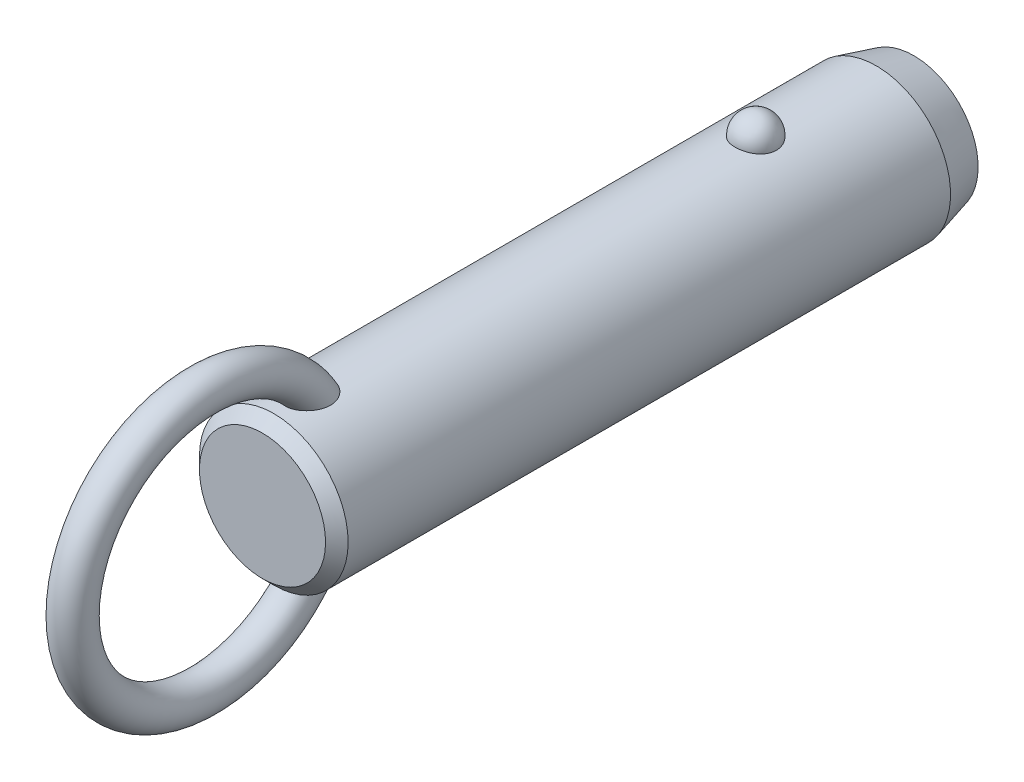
ISO-10303-21;
HEADER;
FILE_DESCRIPTION(('STEP AP214'),'2;1');
FILE_NAME('part.step','',(''),(''),'','','');
FILE_SCHEMA(('AUTOMOTIVE_DESIGN { 1 0 10303 214 1 1 1 1 }'));
ENDSEC;
DATA;
#1=APPLICATION_CONTEXT('core data for automotive mechanical design processes');
#2=APPLICATION_PROTOCOL_DEFINITION('international standard','automotive_design',2000,#1);
#3=PRODUCT_CONTEXT('',#1,'mechanical');
#4=PRODUCT('Part','Part','',(#3));
#5=PRODUCT_RELATED_PRODUCT_CATEGORY('part','',(#4));
#6=PRODUCT_DEFINITION_FORMATION('','',#4);
#7=PRODUCT_DEFINITION_CONTEXT('part definition',#1,'design');
#8=PRODUCT_DEFINITION('design','',#6,#7);
#9=PRODUCT_DEFINITION_SHAPE('','',#8);
#10=(LENGTH_UNIT() NAMED_UNIT(*) SI_UNIT(.MILLI.,.METRE.));
#11=(NAMED_UNIT(*) PLANE_ANGLE_UNIT() SI_UNIT($,.RADIAN.));
#12=(NAMED_UNIT(*) SI_UNIT($,.STERADIAN.) SOLID_ANGLE_UNIT());
#13=UNCERTAINTY_MEASURE_WITH_UNIT(LENGTH_MEASURE(1.E-05),#10,'distance_accuracy_value','');
#14=(GEOMETRIC_REPRESENTATION_CONTEXT(3) GLOBAL_UNCERTAINTY_ASSIGNED_CONTEXT((#13)) GLOBAL_UNIT_ASSIGNED_CONTEXT((#10,
#11,#12)) REPRESENTATION_CONTEXT('',''));
#15=CARTESIAN_POINT('',(0.,0.,0.));
#16=DIRECTION('',(0.,0.,1.));
#17=DIRECTION('',(1.,0.,0.));
#18=AXIS2_PLACEMENT_3D('',#15,#16,#17);
#19=CARTESIAN_POINT('',(0.,0.,40.7));
#20=DIRECTION('',(0.,0.,-1.));
#21=DIRECTION('',(-1.,0.,0.));
#22=AXIS2_PLACEMENT_3D('',#19,#20,#21);
#23=CYLINDRICAL_SURFACE('',#22,7.9);
#24=CARTESIAN_POINT('',(2.1785689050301,7.59367088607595,-2.2));
#25=CARTESIAN_POINT('',(2.17856679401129,7.59367269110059,-2.07701843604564));
#26=CARTESIAN_POINT('',(2.16853481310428,7.59657145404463,-1.95401006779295));
#27=CARTESIAN_POINT('',(2.12864689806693,7.607843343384,-1.71147811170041));
#28=CARTESIAN_POINT('',(2.09878338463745,7.61621856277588,-1.59195587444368));
#29=CARTESIAN_POINT('',(2.0199931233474,7.63749180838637,-1.35985638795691));
#30=CARTESIAN_POINT('',(1.97107475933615,7.6503878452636,-1.24727610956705));
#31=CARTESIAN_POINT('',(1.85539377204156,7.67926115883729,-1.03213234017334));
#32=CARTESIAN_POINT('',(1.78863158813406,7.69523835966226,-0.929568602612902));
#33=CARTESIAN_POINT('',(1.63856494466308,7.7285848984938,-0.736786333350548));
#34=CARTESIAN_POINT('',(1.55518140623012,7.7459606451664,-0.646630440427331));
#35=CARTESIAN_POINT('',(1.37422937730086,7.78009978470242,-0.481747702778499));
#36=CARTESIAN_POINT('',(1.27666086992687,7.79686317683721,-0.407020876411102));
#37=CARTESIAN_POINT('',(1.07024728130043,7.82786153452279,-0.27527810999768));
#38=CARTESIAN_POINT('',(0.961434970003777,7.84210353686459,-0.218212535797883));
#39=CARTESIAN_POINT('',(0.735351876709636,7.86652194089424,-0.123146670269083));
#40=CARTESIAN_POINT('',(0.618082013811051,7.87669878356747,-0.0851443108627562));
#41=CARTESIAN_POINT('',(0.380637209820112,7.89170521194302,-0.0298158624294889));
#42=CARTESIAN_POINT('',(0.260550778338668,7.89662650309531,-0.0121347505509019));
#43=CARTESIAN_POINT('',(0.0190117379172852,7.90090003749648,0.00324379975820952));
#44=CARTESIAN_POINT('',(-0.102440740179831,7.90025280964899,0.000943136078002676));
#45=CARTESIAN_POINT('',(-0.341452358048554,7.89351056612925,-0.0233955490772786));
#46=CARTESIAN_POINT('',(-0.459042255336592,7.88749257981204,-0.045154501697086));
#47=CARTESIAN_POINT('',(-0.688796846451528,7.87075812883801,-0.107408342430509));
#48=CARTESIAN_POINT('',(-0.800961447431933,7.86004158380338,-0.147903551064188));
#49=CARTESIAN_POINT('',(-1.01743634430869,7.83497131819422,-0.246799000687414));
#50=CARTESIAN_POINT('',(-1.12169791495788,7.82059709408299,-0.305300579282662));
#51=CARTESIAN_POINT('',(-1.31891765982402,7.78976470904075,-0.438549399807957));
#52=CARTESIAN_POINT('',(-1.41187469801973,7.77330633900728,-0.51329827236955));
#53=CARTESIAN_POINT('',(-1.58577142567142,7.73972434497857,-0.67862264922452));
#54=CARTESIAN_POINT('',(-1.66645140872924,7.72259402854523,-0.769470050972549));
#55=CARTESIAN_POINT('',(-1.81161503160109,7.68983776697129,-0.963538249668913));
#56=CARTESIAN_POINT('',(-1.87609753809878,7.6742119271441,-1.06675991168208));
#57=CARTESIAN_POINT('',(-1.98790138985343,7.6460202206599,-1.28401170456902));
#58=CARTESIAN_POINT('',(-2.03501994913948,7.63349104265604,-1.39815107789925));
#59=CARTESIAN_POINT('',(-2.10986724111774,7.6131449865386,-1.63301784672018));
#60=CARTESIAN_POINT('',(-2.1375965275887,7.60532797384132,-1.75374505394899));
#61=CARTESIAN_POINT('',(-2.17289256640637,7.5953195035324,-1.99782562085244));
#62=CARTESIAN_POINT('',(-2.18054294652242,7.59310471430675,-2.12116592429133));
#63=CARTESIAN_POINT('',(-2.17572919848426,7.59448538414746,-2.36741799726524));
#64=CARTESIAN_POINT('',(-2.1632656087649,7.59808068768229,-2.49032977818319));
#65=CARTESIAN_POINT('',(-2.11865035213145,7.61064035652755,-2.73161015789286));
#66=CARTESIAN_POINT('',(-2.08659579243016,7.61957823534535,-2.84999812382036));
#67=CARTESIAN_POINT('',(-2.00367799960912,7.64179982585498,-3.07955956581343));
#68=CARTESIAN_POINT('',(-1.9528140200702,7.65508371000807,-3.19073275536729));
#69=CARTESIAN_POINT('',(-1.83321113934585,7.68460381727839,-3.40337899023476));
#70=CARTESIAN_POINT('',(-1.76437735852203,7.70085556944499,-3.50479651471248));
#71=CARTESIAN_POINT('',(-1.61069526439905,7.73445734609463,-3.69446912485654));
#72=CARTESIAN_POINT('',(-1.52584634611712,7.75180741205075,-3.78272371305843));
#73=CARTESIAN_POINT('',(-1.34198059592,7.78574608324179,-3.94393987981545));
#74=CARTESIAN_POINT('',(-1.24291308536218,7.80233167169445,-4.01684434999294));
#75=CARTESIAN_POINT('',(-1.03352039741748,7.83281625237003,-4.14489386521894));
#76=CARTESIAN_POINT('',(-0.92319600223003,7.84671543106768,-4.20004014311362));
#77=CARTESIAN_POINT('',(-0.695822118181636,7.87011575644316,-4.29042017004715));
#78=CARTESIAN_POINT('',(-0.578872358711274,7.87966903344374,-4.32589112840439));
#79=CARTESIAN_POINT('',(-0.340410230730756,7.8935652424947,-4.37692226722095));
#80=CARTESIAN_POINT('',(-0.218898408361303,7.89790879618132,-4.39248482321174));
#81=CARTESIAN_POINT('',(0.0228107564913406,7.90087453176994,-4.4031440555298));
#82=CARTESIAN_POINT('',(0.142990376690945,7.89960185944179,-4.3986168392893));
#83=CARTESIAN_POINT('',(0.380829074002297,7.89171262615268,-4.37008293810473));
#84=CARTESIAN_POINT('',(0.498488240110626,7.8850962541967,-4.34607694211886));
#85=CARTESIAN_POINT('',(0.727535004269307,7.86726442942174,-4.27939317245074));
#86=CARTESIAN_POINT('',(0.838944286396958,7.85606616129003,-4.23678512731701));
#87=CARTESIAN_POINT('',(1.05295421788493,7.83025654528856,-4.13408348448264));
#88=CARTESIAN_POINT('',(1.15555431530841,7.81564498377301,-4.07398879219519));
#89=CARTESIAN_POINT('',(1.35076763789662,7.7843022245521,-3.93687432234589));
#90=CARTESIAN_POINT('',(1.4432046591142,7.76754209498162,-3.85961036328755));
#91=CARTESIAN_POINT('',(1.6139111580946,7.73387857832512,-3.69076949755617));
#92=CARTESIAN_POINT('',(1.6921781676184,7.71697516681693,-3.59919010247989));
#93=CARTESIAN_POINT('',(1.83380875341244,7.6845643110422,-3.40247278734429));
#94=CARTESIAN_POINT('',(1.89689280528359,7.66908588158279,-3.29712873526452));
#95=CARTESIAN_POINT('',(2.0047823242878,7.64159441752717,-3.07707931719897));
#96=CARTESIAN_POINT('',(2.0495945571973,7.62958010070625,-2.96237743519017));
#97=CARTESIAN_POINT('',(2.11580183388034,7.61146617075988,-2.74040519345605));
#98=CARTESIAN_POINT('',(2.13929812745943,7.60484503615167,-2.63379846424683));
#99=CARTESIAN_POINT('',(2.17068242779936,7.59594664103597,-2.41813481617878));
#100=CARTESIAN_POINT('',(2.17857077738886,7.59366928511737,-2.30907795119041));
#101=CARTESIAN_POINT('',(2.1785689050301,7.59367088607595,-2.2));
#102=B_SPLINE_CURVE_WITH_KNOTS('',3,(#24,#25,#26,#27,#28,#29,#30,#31,#32,#33,#34,#35,#36,#37,
#38,#39,#40,#41,#42,#43,#44,#45,#46,#47,#48,#49,#50,#51,#52,#53,#54,#55,#56,#57,#58,#59,#60,#61,
#62,#63,#64,#65,#66,#67,#68,#69,#70,#71,#72,#73,#74,#75,#76,#77,#78,#79,#80,#81,#82,#83,#84,#85,
#86,#87,#88,#89,#90,#91,#92,#93,#94,#95,#96,#97,#98,#99,#100,#101),.UNSPECIFIED.,.T.,.F.,(4,2,2,
2,2,2,2,2,2,2,2,2,2,2,2,2,2,2,2,2,2,2,2,2,2,2,2,2,2,2,2,2,2,2,2,2,2,2,4),(0.,0.368552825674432,
0.737246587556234,1.10577831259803,1.4743009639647,1.8446206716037,2.21494081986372,
2.5842105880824,2.95344028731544,3.31611630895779,3.67875788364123,4.03628044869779,
4.39380913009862,4.75338791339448,5.11300280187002,5.47939989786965,5.8458226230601,
6.21639834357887,6.58696347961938,6.95598276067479,7.32499216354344,7.69218715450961,
8.0593967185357,8.42858578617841,8.79778880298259,9.16834203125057,9.5388695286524,
9.90482699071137,10.2707407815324,10.6298333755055,10.9889132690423,11.3466585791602,
11.7044262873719,12.0676511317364,12.4309391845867,12.8004764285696,13.1698767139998,
13.4967701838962,13.8236564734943),.UNSPECIFIED.);
#103=CARTESIAN_POINT('',(2.1785689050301,7.59367088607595,-2.2));
#104=VERTEX_POINT('',#103);
#105=EDGE_CURVE('E41',#104,#104,#102,.T.);
#106=ORIENTED_EDGE('',*,*,#105,.T.);
#107=EDGE_LOOP('',(#106));
#108=FACE_BOUND('',#107,.T.);
#109=CARTESIAN_POINT('',(0.,0.,49.02));
#110=DIRECTION('',(0.,0.,1.));
#111=DIRECTION('',(1.,0.,0.));
#112=AXIS2_PLACEMENT_3D('',#109,#110,#111);
#113=CIRCLE('',#112,7.9);
#114=CARTESIAN_POINT('',(7.9,0.,49.02));
#115=VERTEX_POINT('',#114);
#116=EDGE_CURVE('E10',#115,#115,#113,.F.);
#117=ORIENTED_EDGE('',*,*,#116,.T.);
#118=EDGE_LOOP('',(#117));
#119=FACE_BOUND('',#118,.T.);
#120=CARTESIAN_POINT('',(-0.630969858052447,-7.87476203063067,42.9124322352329));
#121=CARTESIAN_POINT('',(-0.734180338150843,-7.8664899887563,42.947285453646));
#122=CARTESIAN_POINT('',(-0.83447695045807,-7.85639291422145,42.9908160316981));
#123=CARTESIAN_POINT('',(-1.0262035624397,-7.83366343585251,43.0940948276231));
#124=CARTESIAN_POINT('',(-1.1176141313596,-7.82102565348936,43.1538775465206));
#125=CARTESIAN_POINT('',(-1.28877277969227,-7.79464922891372,43.2878390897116));
#126=CARTESIAN_POINT('',(-1.36854014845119,-7.78091246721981,43.361993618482));
#127=CARTESIAN_POINT('',(-1.51461521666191,-7.75380398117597,43.5224941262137));
#128=CARTESIAN_POINT('',(-1.58092966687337,-7.74043207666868,43.6088339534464));
#129=CARTESIAN_POINT('',(-1.70019064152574,-7.71512522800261,43.7929784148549));
#130=CARTESIAN_POINT('',(-1.75284037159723,-7.70322473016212,43.8909792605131));
#131=CARTESIAN_POINT('',(-1.84263464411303,-7.68224112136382,44.0941029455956));
#132=CARTESIAN_POINT('',(-1.87977299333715,-7.6731591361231,44.1992286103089));
#133=CARTESIAN_POINT('',(-1.94152728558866,-7.65777930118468,44.4232849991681));
#134=CARTESIAN_POINT('',(-1.96475471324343,-7.65179654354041,44.5426167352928));
#135=CARTESIAN_POINT('',(-1.99449499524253,-7.64409642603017,44.7834298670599));
#136=CARTESIAN_POINT('',(-2.0010005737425,-7.64238092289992,44.9049121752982));
#137=CARTESIAN_POINT('',(-1.99856014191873,-7.64302120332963,45.1683409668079));
#138=CARTESIAN_POINT('',(-1.98680021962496,-7.64611845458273,45.3102565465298));
#139=CARTESIAN_POINT('',(-1.94457772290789,-7.65696186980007,45.5911188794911));
#140=CARTESIAN_POINT('',(-1.91409393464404,-7.66471330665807,45.7300620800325));
#141=CARTESIAN_POINT('',(-1.82768670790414,-7.68582947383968,46.0319397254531));
#142=CARTESIAN_POINT('',(-1.76772963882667,-7.70003779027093,46.193686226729));
#143=CARTESIAN_POINT('',(-1.65998501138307,-7.72371550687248,46.4276956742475));
#144=CARTESIAN_POINT('',(-1.62107967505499,-7.73200670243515,46.5042974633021));
#145=CARTESIAN_POINT('',(-1.53727726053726,-7.7491037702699,46.6540798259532));
#146=CARTESIAN_POINT('',(-1.4923821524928,-7.75790947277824,46.7272615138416));
#147=CARTESIAN_POINT('',(-1.37397050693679,-7.77993338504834,46.9028838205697));
#148=CARTESIAN_POINT('',(-1.29690364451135,-7.79328473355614,47.0029557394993));
#149=CARTESIAN_POINT('',(-1.12885487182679,-7.81939266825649,47.1907147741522));
#150=CARTESIAN_POINT('',(-1.03789926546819,-7.83215032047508,47.2784247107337));
#151=CARTESIAN_POINT('',(-0.869532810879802,-7.85231710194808,47.4134148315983));
#152=CARTESIAN_POINT('',(-0.795716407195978,-7.86021093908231,47.465076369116));
#153=CARTESIAN_POINT('',(-0.640813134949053,-7.87434920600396,47.5563815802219));
#154=CARTESIAN_POINT('',(-0.559737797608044,-7.88059619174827,47.5960438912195));
#155=CARTESIAN_POINT('',(-0.406456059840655,-7.88984116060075,47.6543008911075));
#156=CARTESIAN_POINT('',(-0.335227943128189,-7.89321892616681,47.6753848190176));
#157=CARTESIAN_POINT('',(-0.19019307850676,-7.89804235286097,47.7054141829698));
#158=CARTESIAN_POINT('',(-0.11638863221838,-7.89948969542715,47.7143701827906));
#159=CARTESIAN_POINT('',(0.0318414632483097,-7.90028409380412,47.7192915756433));
#160=CARTESIAN_POINT('',(0.106268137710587,-7.89962640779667,47.7152276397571));
#161=CARTESIAN_POINT('',(0.25329066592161,-7.8962818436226,47.6944615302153));
#162=CARTESIAN_POINT('',(0.325885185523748,-7.8935935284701,47.6777504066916));
#163=CARTESIAN_POINT('',(0.481441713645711,-7.88577340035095,47.6287380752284));
#164=CARTESIAN_POINT('',(0.563611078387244,-7.88026321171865,47.594005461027));
#165=CARTESIAN_POINT('',(0.721129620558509,-7.86741729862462,47.5117965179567));
#166=CARTESIAN_POINT('',(0.796466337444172,-7.86007832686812,47.4642975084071));
#167=CARTESIAN_POINT('',(0.971456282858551,-7.84073285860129,47.336513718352));
#168=CARTESIAN_POINT('',(1.06719686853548,-7.82809461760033,47.2510047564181));
#169=CARTESIAN_POINT('',(1.24418921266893,-7.80192439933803,47.066232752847));
#170=CARTESIAN_POINT('',(1.32540832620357,-7.78839049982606,46.9669395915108));
#171=CARTESIAN_POINT('',(1.45199971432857,-7.76559693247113,46.7895760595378));
#172=CARTESIAN_POINT('',(1.5008564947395,-7.75626094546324,46.7139542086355));
#173=CARTESIAN_POINT('',(1.59197749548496,-7.7380727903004,46.5587428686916));
#174=CARTESIAN_POINT('',(1.63423919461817,-7.72922080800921,46.4791518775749));
#175=CARTESIAN_POINT('',(1.71222612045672,-7.71231959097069,46.3166640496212));
#176=CARTESIAN_POINT('',(1.74794516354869,-7.70427111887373,46.233764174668));
#177=CARTESIAN_POINT('',(1.81270113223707,-7.68929240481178,46.0652967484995));
#178=CARTESIAN_POINT('',(1.84173789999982,-7.68236218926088,45.9797291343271));
#179=CARTESIAN_POINT('',(1.89322698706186,-7.6698375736,45.8052870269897));
#180=CARTESIAN_POINT('',(1.91558744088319,-7.66426199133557,45.7163838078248));
#181=CARTESIAN_POINT('',(1.95281367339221,-7.65485915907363,45.5369696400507));
#182=CARTESIAN_POINT('',(1.96767946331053,-7.65103190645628,45.4464586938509));
#183=CARTESIAN_POINT('',(2.00021456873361,-7.64262981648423,45.1737320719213));
#184=CARTESIAN_POINT('',(2.00600691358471,-7.6410871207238,44.9897099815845));
#185=CARTESIAN_POINT('',(1.98445334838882,-7.64669564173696,44.6765019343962));
#186=CARTESIAN_POINT('',(1.96607186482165,-7.65149688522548,44.546618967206));
#187=CARTESIAN_POINT('',(1.90884967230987,-7.6659762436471,44.2916321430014));
#188=CARTESIAN_POINT('',(1.87002101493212,-7.67565148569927,44.166525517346));
#189=CARTESIAN_POINT('',(1.77063986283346,-7.69918471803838,43.9245401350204));
#190=CARTESIAN_POINT('',(1.70993724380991,-7.71307150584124,43.8077250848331));
#191=CARTESIAN_POINT('',(1.56733070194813,-7.74330306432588,43.5881444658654));
#192=CARTESIAN_POINT('',(1.48543692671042,-7.75964665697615,43.4853722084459));
#193=CARTESIAN_POINT('',(1.31346177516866,-7.79047523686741,43.3093800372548));
#194=CARTESIAN_POINT('',(1.22547278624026,-7.80495298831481,43.2341066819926));
#195=CARTESIAN_POINT('',(1.0372435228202,-7.83218597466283,43.1004864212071));
#196=CARTESIAN_POINT('',(0.937008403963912,-7.84494192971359,43.0421324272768));
#197=CARTESIAN_POINT('',(0.733599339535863,-7.86649045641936,42.9470270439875));
#198=CARTESIAN_POINT('',(0.630941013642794,-7.87547134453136,42.9092109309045));
#199=CARTESIAN_POINT('',(0.420465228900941,-7.88950708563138,42.8511160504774));
#200=CARTESIAN_POINT('',(0.312645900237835,-7.89456050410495,42.8308436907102));
#201=CARTESIAN_POINT('',(0.0960869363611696,-7.9001518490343,42.8084559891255));
#202=CARTESIAN_POINT('',(-0.0126341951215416,-7.90073226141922,42.8061698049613));
#203=CARTESIAN_POINT('',(-0.228766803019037,-7.89742350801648,42.8193678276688));
#204=CARTESIAN_POINT('',(-0.336180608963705,-7.89354403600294,42.8348134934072));
#205=CARTESIAN_POINT('',(-0.473410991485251,-7.88586871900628,42.8662177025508));
#206=CARTESIAN_POINT('',(-0.505257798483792,-7.88388984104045,42.8743541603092));
#207=CARTESIAN_POINT('',(-0.568481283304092,-7.87958326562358,42.8922083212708));
#208=CARTESIAN_POINT('',(-0.599857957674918,-7.87725556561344,42.9019260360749));
#209=CARTESIAN_POINT('',(-0.630969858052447,-7.87476203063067,42.9124322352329));
#210=B_SPLINE_CURVE_WITH_KNOTS('',3,(#120,#121,#122,#123,#124,#125,#126,#127,#128,#129,#130,
#131,#132,#133,#134,#135,#136,#137,#138,#139,#140,#141,#142,#143,#144,#145,#146,#147,#148,#149,
#150,#151,#152,#153,#154,#155,#156,#157,#158,#159,#160,#161,#162,#163,#164,#165,#166,#167,#168,
#169,#170,#171,#172,#173,#174,#175,#176,#177,#178,#179,#180,#181,#182,#183,#184,#185,#186,#187,
#188,#189,#190,#191,#192,#193,#194,#195,#196,#197,#198,#199,#200,#201,#202,#203,#204,#205,#206,
#207,#208,#209),.UNSPECIFIED.,.T.,.F.,(4,2,2,2,2,2,2,2,2,2,2,2,2,2,2,2,2,2,2,2,2,2,2,2,2,2,2,2,
2,2,2,2,2,2,2,2,2,2,2,2,2,2,2,2,4),(0.,0.327622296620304,0.655945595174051,0.983718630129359,
1.3113267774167,1.64554655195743,1.97989964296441,2.34365728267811,2.70757317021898,
3.13333684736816,3.55958380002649,4.07655306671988,4.33527897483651,4.593919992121,
4.9738243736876,5.35301797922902,5.62348245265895,5.89352465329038,6.11565959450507,
6.3376009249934,6.56004255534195,6.782641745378,7.04930844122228,7.31645206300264,
7.70130871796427,8.08701995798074,8.35824509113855,8.62957365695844,8.90115735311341,
9.17274746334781,9.44791855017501,9.72308922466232,10.2715298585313,10.6638393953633,
11.0559179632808,11.4507403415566,11.8453740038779,12.1936425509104,12.5417649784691,
12.8695063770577,13.1973674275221,13.5221104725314,13.8461490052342,13.9449071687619,
14.0436660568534),.UNSPECIFIED.);
#211=CARTESIAN_POINT('',(-0.630969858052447,-7.87476203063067,42.9124322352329));
#212=VERTEX_POINT('',#211);
#213=EDGE_CURVE('E59',#212,#212,#210,.T.);
#214=ORIENTED_EDGE('',*,*,#213,.T.);
#215=EDGE_LOOP('',(#214));
#216=FACE_BOUND('',#215,.T.);
#217=CARTESIAN_POINT('',(-0.630969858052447,7.87476203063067,42.9124322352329));
#218=CARTESIAN_POINT('',(-0.528918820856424,7.88293636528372,42.8779798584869));
#219=CARTESIAN_POINT('',(-0.423745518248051,7.8893481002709,42.851915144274));
#220=CARTESIAN_POINT('',(-0.210236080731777,7.8979273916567,42.8172825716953));
#221=CARTESIAN_POINT('',(-0.101893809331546,7.90008607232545,42.8087513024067));
#222=CARTESIAN_POINT('',(0.114660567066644,7.89990877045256,42.8094570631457));
#223=CARTESIAN_POINT('',(0.222872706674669,7.89757640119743,42.8186798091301));
#224=CARTESIAN_POINT('',(0.436107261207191,7.88867538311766,42.8546525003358));
#225=CARTESIAN_POINT('',(0.541131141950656,7.8821087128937,42.8813942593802));
#226=CARTESIAN_POINT('',(0.745085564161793,7.86545130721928,42.9517561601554));
#227=CARTESIAN_POINT('',(0.844015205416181,7.85536005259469,42.9953787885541));
#228=CARTESIAN_POINT('',(1.03299167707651,7.83275153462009,43.0983796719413));
#229=CARTESIAN_POINT('',(1.12303841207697,7.8202342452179,43.1577580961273));
#230=CARTESIAN_POINT('',(1.29214734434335,7.79408219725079,43.2908647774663));
#231=CARTESIAN_POINT('',(1.37116907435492,7.78044359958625,43.3646436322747));
#232=CARTESIAN_POINT('',(1.51597677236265,7.75353170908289,43.5242353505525));
#233=CARTESIAN_POINT('',(1.58176261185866,7.74025841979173,43.6100483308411));
#234=CARTESIAN_POINT('',(1.70057386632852,7.71504069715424,43.793644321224));
#235=CARTESIAN_POINT('',(1.75320073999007,7.7031425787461,43.8916906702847));
#236=CARTESIAN_POINT('',(1.8429376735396,7.68216822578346,44.0948931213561));
#237=CARTESIAN_POINT('',(1.88004278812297,7.67309289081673,44.2000514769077));
#238=CARTESIAN_POINT('',(1.9417232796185,7.6577294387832,44.4241671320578));
#239=CARTESIAN_POINT('',(1.96491037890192,7.65175648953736,44.5435248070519));
#240=CARTESIAN_POINT('',(1.9945689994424,7.64407702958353,44.7843848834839));
#241=CARTESIAN_POINT('',(2.00103304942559,7.64237242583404,44.9058882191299));
#242=CARTESIAN_POINT('',(1.99850166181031,7.64303650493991,45.1693688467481));
#243=CARTESIAN_POINT('',(1.98669038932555,7.64614714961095,45.3113141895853));
#244=CARTESIAN_POINT('',(1.94436120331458,7.6570170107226,45.5922287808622));
#245=CARTESIAN_POINT('',(1.91382203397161,7.66478150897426,45.7311944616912));
#246=CARTESIAN_POINT('',(1.82728754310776,7.68592483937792,46.0331110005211));
#247=CARTESIAN_POINT('',(1.76725778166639,7.7001468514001,46.1948721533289));
#248=CARTESIAN_POINT('',(1.65939700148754,7.72384204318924,46.4288914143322));
#249=CARTESIAN_POINT('',(1.62045187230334,7.73213852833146,46.5054942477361));
#250=CARTESIAN_POINT('',(1.53656684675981,7.74924489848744,46.6552737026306));
#251=CARTESIAN_POINT('',(1.49162892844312,7.75805461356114,46.7284514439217));
#252=CARTESIAN_POINT('',(1.37317698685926,7.78007342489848,46.9039520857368));
#253=CARTESIAN_POINT('',(1.29612360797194,7.79341423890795,47.0039112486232));
#254=CARTESIAN_POINT('',(1.12812043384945,7.81949839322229,47.1914508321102));
#255=CARTESIAN_POINT('',(1.03719688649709,7.83224280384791,47.2790540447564));
#256=CARTESIAN_POINT('',(0.868871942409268,7.85239026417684,47.4138971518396));
#257=CARTESIAN_POINT('',(0.795056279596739,7.86027769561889,47.4655113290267));
#258=CARTESIAN_POINT('',(0.64016072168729,7.87440222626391,47.5567201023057));
#259=CARTESIAN_POINT('',(0.559092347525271,7.88064188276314,47.5963333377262));
#260=CARTESIAN_POINT('',(0.405820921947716,7.8898738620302,47.6545056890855));
#261=CARTESIAN_POINT('',(0.334594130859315,7.89324577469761,47.6755523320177));
#262=CARTESIAN_POINT('',(0.189568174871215,7.89805733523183,47.7055070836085));
#263=CARTESIAN_POINT('',(0.115771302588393,7.89949866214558,47.7144257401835));
#264=CARTESIAN_POINT('',(-0.0324359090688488,7.90028156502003,47.7192758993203));
#265=CARTESIAN_POINT('',(-0.106847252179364,7.89961843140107,47.7151782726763));
#266=CARTESIAN_POINT('',(-0.253834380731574,7.8962642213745,47.6943519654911));
#267=CARTESIAN_POINT('',(-0.32640882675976,7.89357170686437,47.6776143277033));
#268=CARTESIAN_POINT('',(-0.481962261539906,7.88574179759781,47.6285391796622));
#269=CARTESIAN_POINT('',(-0.564145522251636,7.88022507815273,47.5937638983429));
#270=CARTESIAN_POINT('',(-0.721685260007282,7.8673664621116,47.5114686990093));
#271=CARTESIAN_POINT('',(-0.797029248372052,7.8600213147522,47.4639260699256));
#272=CARTESIAN_POINT('',(-0.97204426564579,7.84066026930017,47.3360267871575));
#273=CARTESIAN_POINT('',(-1.06779803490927,7.82801274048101,47.2504436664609));
#274=CARTESIAN_POINT('',(-1.24480531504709,7.80182621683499,47.0655223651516));
#275=CARTESIAN_POINT('',(-1.3260261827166,7.78828530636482,46.9661540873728));
#276=CARTESIAN_POINT('',(-1.45259834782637,7.76548487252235,46.7886806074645));
#277=CARTESIAN_POINT('',(-1.50143856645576,7.75614818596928,46.7130252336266));
#278=CARTESIAN_POINT('',(-1.59252410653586,7.73796020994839,46.5577484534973));
#279=CARTESIAN_POINT('',(-1.63476690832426,7.72910910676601,46.4781255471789));
#280=CARTESIAN_POINT('',(-1.71271318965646,7.71221133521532,46.3155750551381));
#281=CARTESIAN_POINT('',(-1.74841047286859,7.70416543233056,46.2326444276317));
#282=CARTESIAN_POINT('',(-1.81311929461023,7.6891937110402,46.0641168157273));
#283=CARTESIAN_POINT('',(-1.84213067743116,7.6822679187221,45.9785197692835));
#284=CARTESIAN_POINT('',(-1.89356259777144,7.66975461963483,45.8040254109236));
#285=CARTESIAN_POINT('',(-1.91589165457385,7.66418586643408,45.7150995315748));
#286=CARTESIAN_POINT('',(-1.95305070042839,7.65479859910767,45.5356424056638));
#287=CARTESIAN_POINT('',(-1.96788069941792,7.65098008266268,45.4451111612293));
#288=CARTESIAN_POINT('',(-2.00030078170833,7.64260704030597,45.1723270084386));
#289=CARTESIAN_POINT('',(-2.00600576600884,7.64108760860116,44.9882718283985));
#290=CARTESIAN_POINT('',(-1.98428483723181,7.64673945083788,44.6750800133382));
#291=CARTESIAN_POINT('',(-1.96583698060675,7.6515575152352,44.5452400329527));
#292=CARTESIAN_POINT('',(-1.90848948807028,7.66606613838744,44.2903619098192));
#293=CARTESIAN_POINT('',(-1.86960376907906,7.67575338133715,44.165320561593));
#294=CARTESIAN_POINT('',(-1.7701342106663,7.6993013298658,43.9235009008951));
#295=CARTESIAN_POINT('',(-1.70940488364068,7.71318991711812,43.8067844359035));
#296=CARTESIAN_POINT('',(-1.56672953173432,7.74342495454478,43.5873404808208));
#297=CARTESIAN_POINT('',(-1.48478316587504,7.75977144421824,43.4846132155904));
#298=CARTESIAN_POINT('',(-1.31266325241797,7.79061163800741,43.308643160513));
#299=CARTESIAN_POINT('',(-1.22456383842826,7.80509908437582,43.2333589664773));
#300=CARTESIAN_POINT('',(-1.03622400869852,7.83231881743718,43.0998659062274));
#301=CARTESIAN_POINT('',(-0.936015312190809,7.84505551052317,43.0416137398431));
#302=CARTESIAN_POINT('',(-0.798824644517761,7.85957802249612,42.9775408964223));
#303=CARTESIAN_POINT('',(-0.765787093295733,7.86286821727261,42.9632248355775));
#304=CARTESIAN_POINT('',(-0.698939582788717,7.86909211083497,42.936436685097));
#305=CARTESIAN_POINT('',(-0.665129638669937,7.8720258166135,42.9239645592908));
#306=CARTESIAN_POINT('',(-0.630969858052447,7.87476203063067,42.9124322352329));
#307=B_SPLINE_CURVE_WITH_KNOTS('',3,(#217,#218,#219,#220,#221,#222,#223,#224,#225,#226,#227,
#228,#229,#230,#231,#232,#233,#234,#235,#236,#237,#238,#239,#240,#241,#242,#243,#244,#245,#246,
#247,#248,#249,#250,#251,#252,#253,#254,#255,#256,#257,#258,#259,#260,#261,#262,#263,#264,#265,
#266,#267,#268,#269,#270,#271,#272,#273,#274,#275,#276,#277,#278,#279,#280,#281,#282,#283,#284,
#285,#286,#287,#288,#289,#290,#291,#292,#293,#294,#295,#296,#297,#298,#299,#300,#301,#302,#303,
#304,#305,#306),.UNSPECIFIED.,.T.,.F.,(4,2,2,2,2,2,2,2,2,2,2,2,2,2,2,2,2,2,2,2,2,2,2,2,2,2,2,2,
2,2,2,2,2,2,2,2,2,2,2,2,2,2,2,2,4),(0.,0.323920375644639,0.648516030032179,0.972850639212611,
1.29703380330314,1.62126473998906,1.94549915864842,2.27089401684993,2.59629203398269,
2.93059633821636,3.26500707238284,3.6288164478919,3.99278833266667,4.4186542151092,
4.84500434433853,5.36209210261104,5.62087589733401,5.87957448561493,6.25918598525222,
6.63808782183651,6.90846748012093,7.17842501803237,7.40052350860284,7.62242871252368,
7.84483086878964,8.06739077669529,8.33414615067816,8.60137921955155,8.98641454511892,
9.3723041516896,9.64358673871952,9.91497268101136,10.1866142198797,10.4582620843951,
10.7334745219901,11.0086865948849,11.5572126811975,11.9494246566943,12.3413699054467,
12.7359755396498,13.1305875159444,13.4791770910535,13.82687259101,13.9353013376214,
14.0437279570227),.UNSPECIFIED.);
#308=CARTESIAN_POINT('',(-0.630969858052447,7.87476203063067,42.9124322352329));
#309=VERTEX_POINT('',#308);
#310=EDGE_CURVE('E67',#309,#309,#307,.T.);
#311=ORIENTED_EDGE('',*,*,#310,.T.);
#312=EDGE_LOOP('',(#311));
#313=FACE_BOUND('',#312,.T.);
#314=CARTESIAN_POINT('',(0.,0.,-14.9999999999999));
#315=DIRECTION('',(0.,0.,-1.));
#316=DIRECTION('',(-1.,0.,0.));
#317=AXIS2_PLACEMENT_3D('',#314,#315,#316);
#318=CIRCLE('',#317,7.9);
#319=CARTESIAN_POINT('',(-7.9,0.,-14.9999999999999));
#320=VERTEX_POINT('',#319);
#321=EDGE_CURVE('E56',#320,#320,#318,.F.);
#322=ORIENTED_EDGE('',*,*,#321,.T.);
#323=EDGE_LOOP('',(#322));
#324=FACE_BOUND('',#323,.T.);
#325=ADVANCED_FACE('F37',(#108,#119,#216,#313,#324),#23,.T.);
#326=CARTESIAN_POINT('',(0.,0.,-19.));
#327=DIRECTION('',(0.,0.,-1.));
#328=DIRECTION('',(-1.,0.,0.));
#329=AXIS2_PLACEMENT_3D('',#326,#327,#328);
#330=PLANE('',#329);
#331=CARTESIAN_POINT('',(0.,0.,-19.));
#332=DIRECTION('',(0.,0.,-1.));
#333=DIRECTION('',(-1.,0.,0.));
#334=AXIS2_PLACEMENT_3D('',#331,#332,#333);
#335=CIRCLE('',#334,6.82820323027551);
#336=CARTESIAN_POINT('',(-6.82820323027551,0.,-19.));
#337=VERTEX_POINT('',#336);
#338=EDGE_CURVE('E66',#337,#337,#335,.T.);
#339=ORIENTED_EDGE('',*,*,#338,.T.);
#340=EDGE_LOOP('',(#339));
#341=FACE_BOUND('',#340,.T.);
#342=ADVANCED_FACE('F85',(#341),#330,.T.);
#343=CARTESIAN_POINT('',(0.,0.,-19.));
#344=DIRECTION('',(0.,0.,1.));
#345=DIRECTION('',(1.,0.,0.));
#346=AXIS2_PLACEMENT_3D('',#343,#344,#345);
#347=CONICAL_SURFACE('',#346,6.8282032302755,0.261799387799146);
#348=ORIENTED_EDGE('',*,*,#321,.F.);
#349=EDGE_LOOP('',(#348));
#350=FACE_BOUND('',#349,.T.);
#351=ORIENTED_EDGE('',*,*,#338,.F.);
#352=EDGE_LOOP('',(#351));
#353=FACE_BOUND('',#352,.T.);
#354=ADVANCED_FACE('F83',(#350,#353),#347,.T.);
#355=CARTESIAN_POINT('',(0.,0.,50.22));
#356=DIRECTION('',(0.,0.,1.));
#357=DIRECTION('',(1.,0.,0.));
#358=AXIS2_PLACEMENT_3D('',#355,#356,#357);
#359=PLANE('',#358);
#360=CARTESIAN_POINT('',(0.,0.,50.22));
#361=DIRECTION('',(0.,0.,1.));
#362=DIRECTION('',(1.,0.,0.));
#363=AXIS2_PLACEMENT_3D('',#360,#361,#362);
#364=CIRCLE('',#363,6.70000000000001);
#365=CARTESIAN_POINT('',(6.70000000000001,0.,50.22));
#366=VERTEX_POINT('',#365);
#367=EDGE_CURVE('E50',#366,#366,#364,.T.);
#368=ORIENTED_EDGE('',*,*,#367,.T.);
#369=EDGE_LOOP('',(#368));
#370=FACE_BOUND('',#369,.T.);
#371=ADVANCED_FACE('F77',(#370),#359,.T.);
#372=CARTESIAN_POINT('',(0.,0.,56.55));
#373=DIRECTION('',(1.,0.,0.));
#374=DIRECTION('',(0.,0.,-1.));
#375=AXIS2_PLACEMENT_3D('',#372,#373,#374);
#376=TOROIDAL_SURFACE('',#375,13.85,2.);
#377=ORIENTED_EDGE('',*,*,#310,.F.);
#378=EDGE_LOOP('',(#377));
#379=FACE_BOUND('',#378,.T.);
#380=ORIENTED_EDGE('',*,*,#213,.F.);
#381=EDGE_LOOP('',(#380));
#382=FACE_BOUND('',#381,.T.);
#383=ADVANCED_FACE('F73',(#379,#382),#376,.T.);
#384=CARTESIAN_POINT('',(0.,0.,50.22));
#385=DIRECTION('',(0.,0.,-1.));
#386=DIRECTION('',(-1.,0.,0.));
#387=AXIS2_PLACEMENT_3D('',#384,#385,#386);
#388=CONICAL_SURFACE('',#387,6.70000000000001,0.785398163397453);
#389=ORIENTED_EDGE('',*,*,#116,.F.);
#390=EDGE_LOOP('',(#389));
#391=FACE_BOUND('',#390,.T.);
#392=ORIENTED_EDGE('',*,*,#367,.F.);
#393=EDGE_LOOP('',(#392));
#394=FACE_BOUND('',#393,.T.);
#395=ADVANCED_FACE('F39',(#391,#394),#388,.T.);
#396=CARTESIAN_POINT('',(0.,7.9,-2.2));
#397=DIRECTION('',(0.,1.,0.));
#398=DIRECTION('',(0.,0.,-1.));
#399=AXIS2_PLACEMENT_3D('',#396,#397,#398);
#400=SPHERICAL_SURFACE('',#399,2.2);
#401=ORIENTED_EDGE('',*,*,#105,.F.);
#402=EDGE_LOOP('',(#401));
#403=FACE_BOUND('',#402,.T.);
#404=ADVANCED_FACE('F79',(#403),#400,.T.);
#405=CLOSED_SHELL('',(#325,#342,#354,#371,#383,#395,#404));
#406=MANIFOLD_SOLID_BREP('B2',#405);
#407=ADVANCED_BREP_SHAPE_REPRESENTATION('',(#18,#406),#14);
#408=SHAPE_DEFINITION_REPRESENTATION(#9,#407);
ENDSEC;
END-ISO-10303-21;
